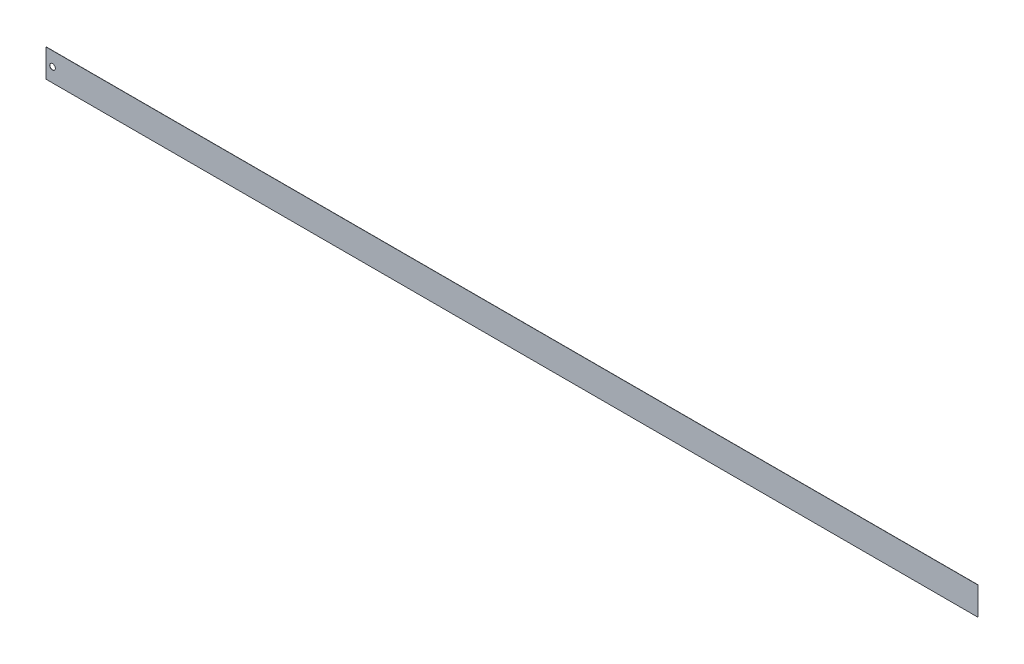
from build123d import *

# Parameters (mm, degrees)
SKETCH1_W           = 500
SKETCH1_H           = 15
SKETCH1_R           = 1.5
BOSS_EXTRUDE3_DEPTH = 0.1


with BuildPart() as part:
    # Sketch1 → Boss-Extrude3 (new body)
    with BuildSketch(Plane.XY):
        with Locations((178.481607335, 16.619795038)):
            Rectangle(SKETCH1_W, SKETCH1_H)
        with Locations((-68.018392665, 16.619795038)):
            Circle(SKETCH1_R, mode=Mode.SUBTRACT)
    extrude(amount=BOSS_EXTRUDE3_DEPTH)


solid = part.part
